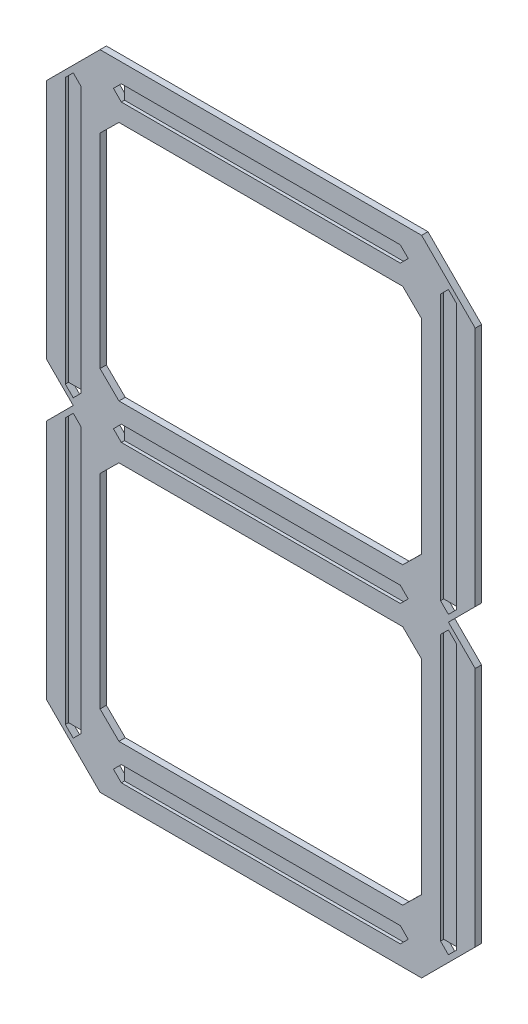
from build123d import *

# Parameters (mm, degrees)
BOSS_EXTRUDE1_DEPTH     = 6
CUT_EXTRUDE1_DEPTH      = 3
CUT_EXTRUDE2_DEPTH      = 90.678
CUT_EXTRUDE2_DEPTH_BACK = 127


with BuildPart() as part:
    # Sketch1 → Boss-Extrude1 (new body)
    with BuildSketch(Plane.XY):
        Polygon((-203.2, 25.4), (-203.2, 254), (-152.4, 304.8), (152.4, 304.8), (203.2, 254), (203.2, 25.4), (177.8, 0), (203.2, -25.4), (203.2, -254), (152.4, -304.8), (-152.4, -304.8), (-203.2, -254), (-203.2, -25.4), (-177.8, 0), align=None)
        Polygon((-152.4, 43.041002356), (-152.4, 236.358997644), (-134.493, 254), (134.493, 254), (152.4, 236.358997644), (152.4, 43.041002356), (134.493, 25.4), (-134.493, 25.4), align=None, mode=Mode.SUBTRACT)
        Polygon((-152.4, -236.358997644), (-152.4, -43.041002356), (-134.493, -25.4), (134.493, -25.4), (152.4, -43.041002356), (152.4, -236.358997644), (134.493, -254), (-134.493, -254), align=None, mode=Mode.SUBTRACT)
    extrude(amount=-BOSS_EXTRUDE1_DEPTH)

    # Sketch2 → Cut-Extrude1 (cut)
    with BuildSketch(Plane.XY):
        Polygon((-185.3, 13.85), (-185.3, 265.55), (-177.8, 273.05), (-170.3, 265.55), (-170.3, 13.85), (-177.8, 6.35), align=None)
        Polygon((-139.7, 279.4), (-132.2, 286.9), (132.2, 286.9), (139.7, 279.4), (132.2, 271.9), (-132.2, 271.9), align=None)
        Polygon((185.3, -13.85), (185.3, -265.55), (177.8, -273.05), (170.3, -265.55), (170.3, -13.85), (177.8, -6.35), align=None)
        Polygon((177.8, 6.35), (170.3, 13.85), (170.3, 265.55), (177.8, 273.05), (185.3, 265.55), (185.3, 13.85), align=None)
        Polygon((139.7, 0), (132.2, 7.5), (-132.2, 7.5), (-139.7, 0), (-132.2, -7.5), (132.2, -7.5), align=None)
        Polygon((-177.8, -6.35), (-170.3, -13.85), (-170.3, -265.55), (-177.8, -273.05), (-185.3, -265.55), (-185.3, -13.85), align=None)
        Polygon((139.7, -279.4), (132.2, -271.9), (-132.2, -271.9), (-139.7, -279.4), (-132.2, -286.9), (132.2, -286.9), align=None)
    extrude(amount=-CUT_EXTRUDE1_DEPTH, mode=Mode.SUBTRACT)

    # Sketch3 → Cut-Extrude2 (cut, two sides: drawn at the far end of the back side and taken through both)
    with BuildSketch(Plane.XY.offset(-CUT_EXTRUDE2_DEPTH_BACK)):
        Polygon((-185.3, 13.85), (-170.3, 13.85), (-177.8, 6.35), align=None)
        Polygon((-132.2, 7.5), (-132.2, -7.5), (-139.7, 0), align=None)
        Polygon((-185.3, -265.55), (-170.3, -265.55), (-177.8, -273.05), align=None)
        Polygon((-132.2, -271.9), (-132.2, -286.9), (-139.7, -279.4), align=None)
        Polygon((170.3, -265.55), (185.3, -265.55), (177.8, -273.05), align=None)
        Polygon((170.3, 13.85), (185.3, 13.85), (177.8, 6.35), align=None)
        Polygon((-132.2, 286.9), (-132.2, 271.9), (-139.7, 279.4), align=None)
    extrude(amount=CUT_EXTRUDE2_DEPTH + CUT_EXTRUDE2_DEPTH_BACK, mode=Mode.SUBTRACT)


solid = part.part
